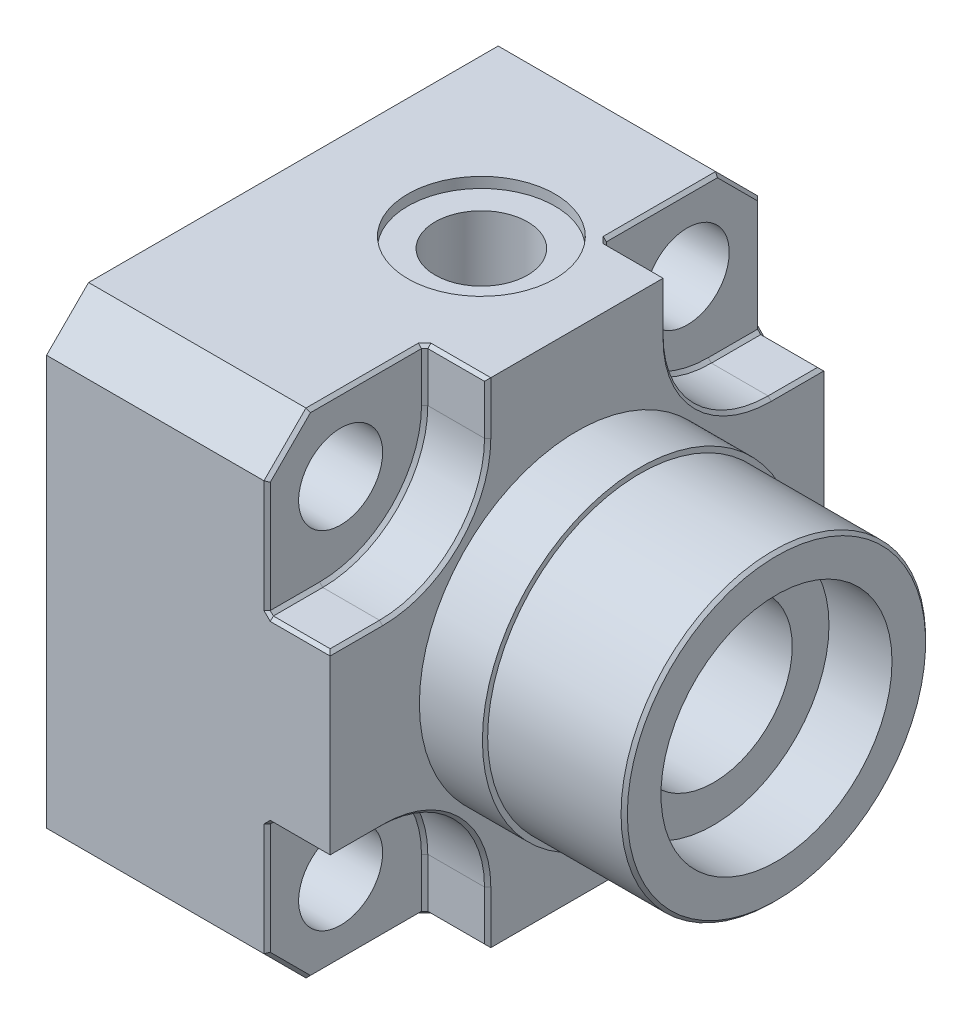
from build123d import *

# Parameters (mm, degrees)
SKETCH1_W                         = 47
SKETCH1_H                         = 47
EXTRUDE1_DEPTH                    = 27
CHAMFER1_SIZE                     = 4
SKETCH4_R                         = 15
EXTRUDE2_DEPTH                    = 6
SKETCH5_R                         = 16.5
EXTRUDE3_DEPTH                    = 7
SKETCH6_R                         = 1
TAP_DRILL_FOR_M10X1_25_TAP1_D     = 8.8
TAP_DRILL_FOR_M10X1_25_TAP1_DEPTH = 23
TAP_DRILL_FOR_M10X1_25_TAP1_TIP   = 2.643786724
SKETCH14_R                        = 7
CUT_EXTRUDE2_DEPTH                = 1
SKETCH11_R                        = 14.5
EXTRUDE4_DEPTH                    = 13
CHAMFER2_SIZE                     = 0.3
SKETCH7_R                         = 7.5
CUT_EXTRUDE1_DEPTH                = 86.011763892
CUT_EXTRUDE3_DEPTH                = 6
CHAMFER3_SIZE                     = 0.3
SKETCH17_R                        = 4
CUT_EXTRUDE4_DEPTH                = 73.12489172
CIRPATTERN2_COUNT                 = 4
CHAMFER4_SIZE                     = 0.3
CHAMFER5_SIZE                     = 0.3
SKETCH21_R                        = 11
CUT_EXTRUDE5_DEPTH                = 6


with BuildPart() as part:
    # Sketch1 → Extrude1 (new body)
    with BuildSketch(Plane(origin=(0, 0, 0), x_dir=(0, 0, -1), z_dir=(1, 0, 0))):
        with Locations((23.5, 23.5)):
            Rectangle(SKETCH1_W, SKETCH1_H)
    extrude(amount=EXTRUDE1_DEPTH)

    # Chamfer1
    chamfer1_edges = [part.edges().sort_by_distance(p)[0] for p in [
        (13.5, 47, 0),
        (13.5, 47, -47),
        (13.5, 0, -47),
        (13.5, 0, 0),
    ]]
    chamfer(chamfer1_edges, length=CHAMFER1_SIZE)

    # Sketch4 → Extrude2 (add)
    with BuildSketch(Plane(origin=(27, 0, 0), x_dir=(0, 0, -1), z_dir=(1, 0, 0))):
        with Locations(Location((23.5, 23.5, 0), (0, 0, 180))):
            Circle(SKETCH4_R)
    extrude(amount=EXTRUDE2_DEPTH)

    # Sketch5 → Extrude3 (add)
    with BuildSketch(Plane.ZY):
        with Locations((-23.5, 23.5)):
            Circle(SKETCH5_R)
    extrude(amount=EXTRUDE3_DEPTH)

    # Sketch6 → Cut-Revolve1 (revolve, cut)
    with BuildSketch(Plane(origin=(0, 23.5, 0), x_dir=(-1, 0, 0), z_dir=(0, 1, 0)), mode=Mode.PRIVATE) as cut_revolve1_sk:
        with Locations((3.391548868, -7.036783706)):
            Circle(SKETCH6_R)
    revolve(cut_revolve1_sk.sketch.rotate(Axis((0, 23.5, -23.5), (-1, 0, 0)), 180), axis=Axis((0, 23.5, -23.5), (-1, 0, 0)), mode=Mode.SUBTRACT)

    # Tap Drill for M10x1.25 Tap1
    with Locations(Plane(origin=(0, 47, 0), x_dir=(-1, 0, 0), z_dir=(0, 1, 0))):
        with Locations((-14.89655876, -26.505552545)):
            Hole(TAP_DRILL_FOR_M10X1_25_TAP1_D / 2, depth=TAP_DRILL_FOR_M10X1_25_TAP1_DEPTH)
            with Locations((0, 0, -(TAP_DRILL_FOR_M10X1_25_TAP1_DEPTH + TAP_DRILL_FOR_M10X1_25_TAP1_TIP / 2))):  # 118° drill point
                Cone(0, TAP_DRILL_FOR_M10X1_25_TAP1_D / 2, TAP_DRILL_FOR_M10X1_25_TAP1_TIP, mode=Mode.SUBTRACT)

    # Sketch14 → Cut-Extrude2 (cut)
    with BuildSketch(Plane(origin=(0, 47, 0), x_dir=(1, 0, 0), z_dir=(0, 1, 0))):
        with Locations(Location((14.89655876, 26.505552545, 0), (0, 0, 270))):
            Circle(SKETCH14_R)
    extrude(amount=-CUT_EXTRUDE2_DEPTH, mode=Mode.SUBTRACT)

    # Sketch11 → Extrude4 (add)
    with BuildSketch(Plane(origin=(33, 0, 0), x_dir=(0, 0, -1), z_dir=(1, 0, 0))):
        with Locations(Location((23.5, 23.5, 0), (0, 0, 180))):
            Circle(SKETCH11_R)
    extrude(amount=EXTRUDE4_DEPTH)

    # Chamfer2
    chamfer2_edges = [part.edges().sort_by_distance(p)[0] for p in [
        (46, 23.5, -38),
    ]]
    chamfer(chamfer2_edges, length=CHAMFER2_SIZE)

    # Sketch7 → Cut-Extrude1 (cut, through all)
    with BuildSketch(Plane.ZY.offset(7)):
        with Locations((-23.5, 23.5)):
            Circle(SKETCH7_R)
    extrude(amount=-CUT_EXTRUDE1_DEPTH, mode=Mode.SUBTRACT)

    # Sketch15 → Cut-Extrude3 (cut)
    with BuildSketch(Plane(origin=(27, 0, 0), x_dir=(0, 0, -1), z_dir=(1, 0, 0))):
        with BuildLine():
            Line((0, 47), (15, 47))
            Line((15, 47), (15, 42))
            ThreePointArc((15, 42), (12.071067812, 34.928932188), (5, 32))
            Line((5, 32), (0, 32))
            Line((0, 32), (0, 47))
        make_face()
    cut_extrude3 = extrude(amount=-CUT_EXTRUDE3_DEPTH, mode=Mode.SUBTRACT)

    # Chamfer3
    chamfer3_edges = [part.edges().sort_by_distance(p)[0] for p in [
        (21, 45, -2),
        (21, 37.5, 0),
        (24, 32, 0),
        (21, 47, -9.5),
        (21, 44.5, -15),
        (24, 47, -15),
        (21, 34.928932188, -12.071067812),
        (21, 32, -2.5),
        (27, 32, -2.5),
        (27, 34.928932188, -12.071067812),
        (27, 44.5, -15),
    ]]
    chamfer(chamfer3_edges, length=CHAMFER3_SIZE)

    # Sketch17 → Cut-Extrude4 (cut, through all)
    with BuildSketch(Plane(origin=(21, 0, 0), x_dir=(0, 0, -1), z_dir=(1, 0, 0))):
        with Locations((7, 40)):
            Circle(SKETCH17_R)
    cut_extrude4 = extrude(amount=-CUT_EXTRUDE4_DEPTH, mode=Mode.SUBTRACT)

    # CirPattern2: Cut-Extrude3, Cut-Extrude4 ×4 about axis
    cirpattern2_axis = Axis((0, 23.5, -23.5), (1, 0, 0))
    add([cut_extrude3.rotate(cirpattern2_axis, i * 360 / CIRPATTERN2_COUNT) for i in range(1, CIRPATTERN2_COUNT)], mode=Mode.SUBTRACT)
    add([cut_extrude4.rotate(cirpattern2_axis, i * 360 / CIRPATTERN2_COUNT) for i in range(1, CIRPATTERN2_COUNT)], mode=Mode.SUBTRACT)

    # Chamfer4
    chamfer4_edges = [part.edges().sort_by_distance(p)[0] for p in [
        (21, 2, -2),
        (21, 0, -9.5),
        (24, 0, -15),
        (21, 9.5, 0),
        (21, 15, -2.5),
        (24, 15, 0),
        (21, 12.071067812, -12.071067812),
        (21, 2.5, -15),
        (27, 2.5, -15),
        (27, 12.071067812, -12.071067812),
        (27, 15, -2.5),
    ]]
    chamfer(chamfer4_edges, length=CHAMFER4_SIZE)

    # Chamfer5
    chamfer5_edges = [part.edges().sort_by_distance(p)[0] for p in [
        (21, 2, -45),
        (21, 9.5, -47),
        (24, 15, -47),
        (21, 0, -37.5),
        (21, 2.5, -32),
        (24, 0, -32),
        (21, 12.071067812, -34.928932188),
        (21, 15, -44.5),
        (27, 15, -44.5),
        (27, 12.071067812, -34.928932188),
        (27, 2.5, -32),
        (21, 45, -45),
        (21, 47, -37.5),
        (24, 47, -32),
        (21, 37.5, -47),
        (21, 32, -44.5),
        (24, 32, -47),
        (21, 34.928932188, -34.928932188),
        (21, 44.5, -32),
        (27, 44.5, -32),
        (27, 34.928932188, -34.928932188),
        (27, 32, -44.5),
    ]]
    chamfer(chamfer5_edges, length=CHAMFER5_SIZE)

    # Sketch21 → Cut-Extrude5 (cut)
    with BuildSketch(Plane(origin=(46, 0, 0), x_dir=(0, 0, -1), z_dir=(1, 0, 0))):
        with Locations((23.5, 23.5)):
            Circle(SKETCH21_R)
    extrude(amount=-CUT_EXTRUDE5_DEPTH, mode=Mode.SUBTRACT)


solid = part.part
